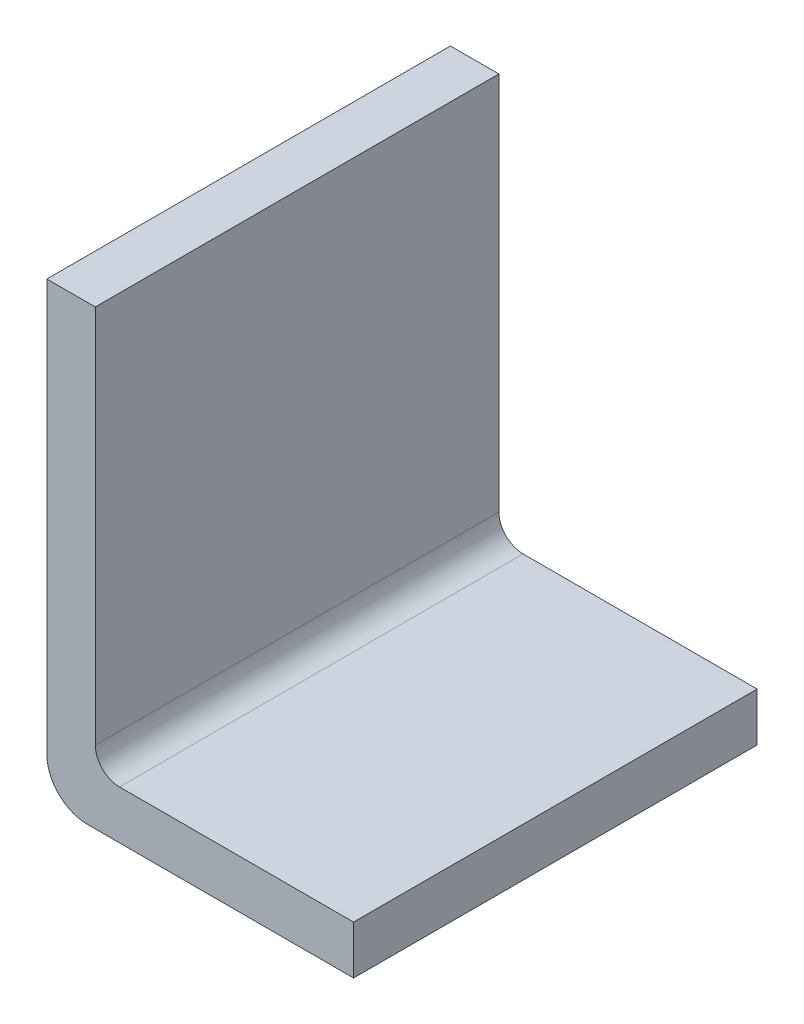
from build123d import *

# Parameters (mm, degrees)
EXTRUDE_1_DEPTH = 50


with BuildPart() as part:
    # Sketch 1 → Extrude 1 (new body)
    with BuildSketch(Plane.XY):
        with BuildLine():
            Line((0, 56), (0, 5))
            ThreePointArc((0, 5), (1.464466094, 1.464466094), (5, 0))
            Line((5, 0), (38, 0))
            Line((38, 0), (38, 6))
            Line((38, 6), (9, 6))
            ThreePointArc((9, 6), (6.878679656, 6.878679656), (6, 9))
            Line((6, 9), (6, 56))
            Line((6, 56), (0, 56))
        make_face()
    extrude(amount=EXTRUDE_1_DEPTH)


solid = part.part
